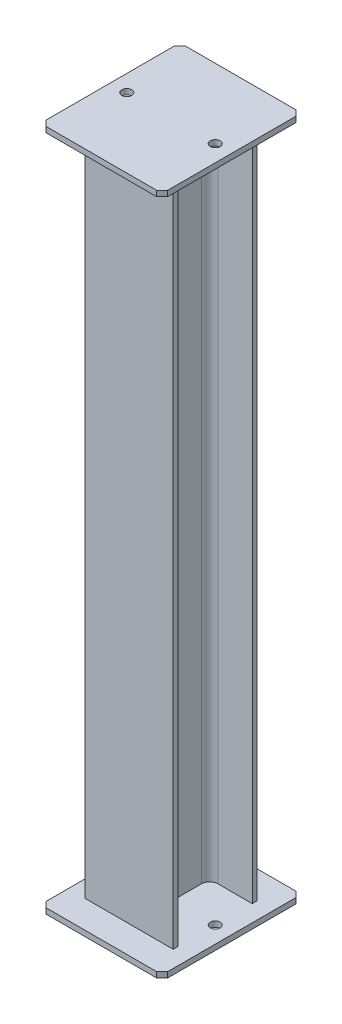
ISO-10303-21;
HEADER;
FILE_DESCRIPTION(('STEP AP214'),'2;1');
FILE_NAME('part.step','',(''),(''),'','','');
FILE_SCHEMA(('AUTOMOTIVE_DESIGN { 1 0 10303 214 1 1 1 1 }'));
ENDSEC;
DATA;
#1=APPLICATION_CONTEXT('core data for automotive mechanical design processes');
#2=APPLICATION_PROTOCOL_DEFINITION('international standard','automotive_design',2000,#1);
#3=PRODUCT_CONTEXT('',#1,'mechanical');
#4=PRODUCT('Part','Part','',(#3));
#5=PRODUCT_RELATED_PRODUCT_CATEGORY('part','',(#4));
#6=PRODUCT_DEFINITION_FORMATION('','',#4);
#7=PRODUCT_DEFINITION_CONTEXT('part definition',#1,'design');
#8=PRODUCT_DEFINITION('design','',#6,#7);
#9=PRODUCT_DEFINITION_SHAPE('','',#8);
#10=(LENGTH_UNIT() NAMED_UNIT(*) SI_UNIT(.MILLI.,.METRE.));
#11=(NAMED_UNIT(*) PLANE_ANGLE_UNIT() SI_UNIT($,.RADIAN.));
#12=(NAMED_UNIT(*) SI_UNIT($,.STERADIAN.) SOLID_ANGLE_UNIT());
#13=UNCERTAINTY_MEASURE_WITH_UNIT(LENGTH_MEASURE(1.E-05),#10,'distance_accuracy_value','');
#14=(GEOMETRIC_REPRESENTATION_CONTEXT(3) GLOBAL_UNCERTAINTY_ASSIGNED_CONTEXT((#13)) GLOBAL_UNIT_ASSIGNED_CONTEXT((#10,
#11,#12)) REPRESENTATION_CONTEXT('',''));
#15=CARTESIAN_POINT('',(0.,0.,0.));
#16=DIRECTION('',(0.,0.,1.));
#17=DIRECTION('',(1.,0.,0.));
#18=AXIS2_PLACEMENT_3D('',#15,#16,#17);
#19=CARTESIAN_POINT('',(0.,617.,0.));
#20=DIRECTION('',(0.,-1.,0.));
#21=DIRECTION('',(0.,0.,1.));
#22=AXIS2_PLACEMENT_3D('',#19,#20,#21);
#23=PLANE('',#22);
#24=DIRECTION('',(-1.,0.,0.));
#25=VECTOR('',#24,1.);
#26=CARTESIAN_POINT('',(110.,617.,126.));
#27=LINE('',#26,#25);
#28=CARTESIAN_POINT('',(100.,617.,126.));
#29=VERTEX_POINT('',#28);
#30=CARTESIAN_POINT('',(-99.9999999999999,617.,126.));
#31=VERTEX_POINT('',#30);
#32=EDGE_CURVE('E183',#29,#31,#27,.T.);
#33=ORIENTED_EDGE('',*,*,#32,.F.);
#34=DIRECTION('',(0.707106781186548,0.,-0.707106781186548));
#35=VECTOR('',#34,1.);
#36=CARTESIAN_POINT('',(100.,617.,126.));
#37=LINE('',#36,#35);
#38=CARTESIAN_POINT('',(110.,617.,116.));
#39=VERTEX_POINT('',#38);
#40=EDGE_CURVE('E220',#39,#29,#37,.F.);
#41=ORIENTED_EDGE('',*,*,#40,.F.);
#42=DIRECTION('',(0.,0.,1.));
#43=VECTOR('',#42,1.);
#44=CARTESIAN_POINT('',(110.,617.,126.));
#45=LINE('',#44,#43);
#46=CARTESIAN_POINT('',(110.,617.,-116.));
#47=VERTEX_POINT('',#46);
#48=EDGE_CURVE('E239',#47,#39,#45,.T.);
#49=ORIENTED_EDGE('',*,*,#48,.F.);
#50=DIRECTION('',(-0.707106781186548,0.,-0.707106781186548));
#51=VECTOR('',#50,1.);
#52=CARTESIAN_POINT('',(110.,617.,-116.));
#53=LINE('',#52,#51);
#54=CARTESIAN_POINT('',(100.,617.,-126.));
#55=VERTEX_POINT('',#54);
#56=EDGE_CURVE('E210',#55,#47,#53,.F.);
#57=ORIENTED_EDGE('',*,*,#56,.F.);
#58=DIRECTION('',(1.,0.,0.));
#59=VECTOR('',#58,1.);
#60=CARTESIAN_POINT('',(110.,617.,-126.));
#61=LINE('',#60,#59);
#62=CARTESIAN_POINT('',(-99.9999999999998,617.,-126.));
#63=VERTEX_POINT('',#62);
#64=EDGE_CURVE('E232',#63,#55,#61,.T.);
#65=ORIENTED_EDGE('',*,*,#64,.F.);
#66=DIRECTION('',(-0.707106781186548,0.,0.707106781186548));
#67=VECTOR('',#66,1.);
#68=CARTESIAN_POINT('',(-99.9999999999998,617.,-126.));
#69=LINE('',#68,#67);
#70=CARTESIAN_POINT('',(-110.,617.,-116.));
#71=VERTEX_POINT('',#70);
#72=EDGE_CURVE('E179',#71,#63,#69,.F.);
#73=ORIENTED_EDGE('',*,*,#72,.F.);
#74=DIRECTION('',(0.,0.,-1.));
#75=VECTOR('',#74,1.);
#76=CARTESIAN_POINT('',(-110.,617.,126.));
#77=LINE('',#76,#75);
#78=CARTESIAN_POINT('',(-110.,617.,116.));
#79=VERTEX_POINT('',#78);
#80=EDGE_CURVE('E230',#79,#71,#77,.T.);
#81=ORIENTED_EDGE('',*,*,#80,.F.);
#82=DIRECTION('',(0.707106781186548,0.,0.707106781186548));
#83=VECTOR('',#82,1.);
#84=CARTESIAN_POINT('',(-110.,617.,116.));
#85=LINE('',#84,#83);
#86=EDGE_CURVE('E14',#31,#79,#85,.F.);
#87=ORIENTED_EDGE('',*,*,#86,.F.);
#88=EDGE_LOOP('',(#33,#41,#49,#57,#65,#73,#81,#87));
#89=FACE_BOUND('',#88,.T.);
#90=CARTESIAN_POINT('',(-79.9999999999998,617.,0.));
#91=DIRECTION('',(0.,-1.,0.));
#92=DIRECTION('',(1.,0.,0.));
#93=AXIS2_PLACEMENT_3D('',#90,#91,#92);
#94=CIRCLE('',#93,9.);
#95=CARTESIAN_POINT('',(-70.9999999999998,617.,0.));
#96=VERTEX_POINT('',#95);
#97=EDGE_CURVE('E237',#96,#96,#94,.T.);
#98=ORIENTED_EDGE('',*,*,#97,.T.);
#99=EDGE_LOOP('',(#98));
#100=FACE_BOUND('',#99,.T.);
#101=CARTESIAN_POINT('',(80.0000000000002,617.,0.));
#102=DIRECTION('',(0.,-1.,0.));
#103=DIRECTION('',(1.,0.,0.));
#104=AXIS2_PLACEMENT_3D('',#101,#102,#103);
#105=CIRCLE('',#104,9.);
#106=CARTESIAN_POINT('',(89.0000000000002,617.,0.));
#107=VERTEX_POINT('',#106);
#108=EDGE_CURVE('E246',#107,#107,#105,.T.);
#109=ORIENTED_EDGE('',*,*,#108,.T.);
#110=EDGE_LOOP('',(#109));
#111=FACE_BOUND('',#110,.T.);
#112=ADVANCED_FACE('F109',(#89,#100,#111),#23,.F.);
#113=CARTESIAN_POINT('',(0.,607.,0.));
#114=DIRECTION('',(0.,-1.,0.));
#115=DIRECTION('',(0.,0.,1.));
#116=AXIS2_PLACEMENT_3D('',#113,#114,#115);
#117=PLANE('',#116);
#118=CARTESIAN_POINT('',(-79.9999999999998,607.,0.));
#119=DIRECTION('',(0.,-1.,0.));
#120=DIRECTION('',(1.,0.,0.));
#121=AXIS2_PLACEMENT_3D('',#118,#119,#120);
#122=CIRCLE('',#121,9.);
#123=CARTESIAN_POINT('',(-70.9999999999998,607.,0.));
#124=VERTEX_POINT('',#123);
#125=EDGE_CURVE('E243',#124,#124,#122,.T.);
#126=ORIENTED_EDGE('',*,*,#125,.F.);
#127=EDGE_LOOP('',(#126));
#128=FACE_BOUND('',#127,.T.);
#129=DIRECTION('',(0.,0.,-1.));
#130=VECTOR('',#129,1.);
#131=CARTESIAN_POINT('',(-110.,607.,126.));
#132=LINE('',#131,#130);
#133=CARTESIAN_POINT('',(-110.,607.,116.));
#134=VERTEX_POINT('',#133);
#135=CARTESIAN_POINT('',(-110.,607.,-116.));
#136=VERTEX_POINT('',#135);
#137=EDGE_CURVE('E193',#134,#136,#132,.T.);
#138=ORIENTED_EDGE('',*,*,#137,.T.);
#139=DIRECTION('',(0.707106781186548,0.,-0.707106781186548));
#140=VECTOR('',#139,1.);
#141=CARTESIAN_POINT('',(-113.,607.,-113.));
#142=LINE('',#141,#140);
#143=CARTESIAN_POINT('',(-99.9999999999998,607.,-126.));
#144=VERTEX_POINT('',#143);
#145=EDGE_CURVE('E176',#144,#136,#142,.F.);
#146=ORIENTED_EDGE('',*,*,#145,.F.);
#147=DIRECTION('',(1.,0.,0.));
#148=VECTOR('',#147,1.);
#149=CARTESIAN_POINT('',(110.,607.,-126.));
#150=LINE('',#149,#148);
#151=CARTESIAN_POINT('',(100.,607.,-126.));
#152=VERTEX_POINT('',#151);
#153=EDGE_CURVE('E186',#144,#152,#150,.T.);
#154=ORIENTED_EDGE('',*,*,#153,.T.);
#155=DIRECTION('',(0.707106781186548,0.,0.707106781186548));
#156=VECTOR('',#155,1.);
#157=CARTESIAN_POINT('',(113.,607.,-113.));
#158=LINE('',#157,#156);
#159=CARTESIAN_POINT('',(110.,607.,-116.));
#160=VERTEX_POINT('',#159);
#161=EDGE_CURVE('E207',#160,#152,#158,.F.);
#162=ORIENTED_EDGE('',*,*,#161,.F.);
#163=DIRECTION('',(0.,0.,1.));
#164=VECTOR('',#163,1.);
#165=CARTESIAN_POINT('',(110.,607.,126.));
#166=LINE('',#165,#164);
#167=CARTESIAN_POINT('',(110.,607.,116.));
#168=VERTEX_POINT('',#167);
#169=EDGE_CURVE('E192',#160,#168,#166,.T.);
#170=ORIENTED_EDGE('',*,*,#169,.T.);
#171=DIRECTION('',(-0.707106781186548,0.,0.707106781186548));
#172=VECTOR('',#171,1.);
#173=CARTESIAN_POINT('',(113.,607.,113.));
#174=LINE('',#173,#172);
#175=CARTESIAN_POINT('',(100.,607.,126.));
#176=VERTEX_POINT('',#175);
#177=EDGE_CURVE('E215',#176,#168,#174,.F.);
#178=ORIENTED_EDGE('',*,*,#177,.F.);
#179=DIRECTION('',(-1.,0.,0.));
#180=VECTOR('',#179,1.);
#181=CARTESIAN_POINT('',(110.,607.,126.));
#182=LINE('',#181,#180);
#183=CARTESIAN_POINT('',(-99.9999999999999,607.,126.));
#184=VERTEX_POINT('',#183);
#185=EDGE_CURVE('E228',#176,#184,#182,.T.);
#186=ORIENTED_EDGE('',*,*,#185,.T.);
#187=DIRECTION('',(-0.707106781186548,0.,-0.707106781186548));
#188=VECTOR('',#187,1.);
#189=CARTESIAN_POINT('',(-113.,607.,113.));
#190=LINE('',#189,#188);
#191=EDGE_CURVE('E225',#134,#184,#190,.F.);
#192=ORIENTED_EDGE('',*,*,#191,.F.);
#193=EDGE_LOOP('',(#138,#146,#154,#162,#170,#178,#186,#192));
#194=FACE_BOUND('',#193,.T.);
#195=CARTESIAN_POINT('',(80.0000000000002,607.,0.));
#196=DIRECTION('',(0.,-1.,0.));
#197=DIRECTION('',(1.,0.,0.));
#198=AXIS2_PLACEMENT_3D('',#195,#196,#197);
#199=CIRCLE('',#198,9.);
#200=CARTESIAN_POINT('',(89.0000000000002,607.,0.));
#201=VERTEX_POINT('',#200);
#202=EDGE_CURVE('E249',#201,#201,#199,.T.);
#203=ORIENTED_EDGE('',*,*,#202,.F.);
#204=EDGE_LOOP('',(#203));
#205=FACE_BOUND('',#204,.T.);
#206=ADVANCED_FACE('F195',(#128,#194,#205),#117,.T.);
#207=CARTESIAN_POINT('',(-110.,617.,126.));
#208=DIRECTION('',(1.,0.,0.));
#209=DIRECTION('',(0.,0.,-1.));
#210=AXIS2_PLACEMENT_3D('',#207,#208,#209);
#211=PLANE('',#210);
#212=ORIENTED_EDGE('',*,*,#80,.T.);
#213=DIRECTION('',(0.,1.,0.));
#214=VECTOR('',#213,1.);
#215=CARTESIAN_POINT('',(-110.,617.,-116.));
#216=LINE('',#215,#214);
#217=EDGE_CURVE('E199',#136,#71,#216,.T.);
#218=ORIENTED_EDGE('',*,*,#217,.F.);
#219=ORIENTED_EDGE('',*,*,#137,.F.);
#220=DIRECTION('',(0.,-1.,0.));
#221=VECTOR('',#220,1.);
#222=CARTESIAN_POINT('',(-110.,617.,116.));
#223=LINE('',#222,#221);
#224=EDGE_CURVE('E223',#79,#134,#223,.T.);
#225=ORIENTED_EDGE('',*,*,#224,.F.);
#226=EDGE_LOOP('',(#212,#218,#219,#225));
#227=FACE_BOUND('',#226,.T.);
#228=ADVANCED_FACE('F263',(#227),#211,.F.);
#229=CARTESIAN_POINT('',(110.,617.,-126.));
#230=DIRECTION('',(0.,0.,1.));
#231=DIRECTION('',(1.,0.,0.));
#232=AXIS2_PLACEMENT_3D('',#229,#230,#231);
#233=PLANE('',#232);
#234=ORIENTED_EDGE('',*,*,#153,.F.);
#235=DIRECTION('',(0.,-1.,0.));
#236=VECTOR('',#235,1.);
#237=CARTESIAN_POINT('',(-99.9999999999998,617.,-126.));
#238=LINE('',#237,#236);
#239=EDGE_CURVE('E172',#63,#144,#238,.T.);
#240=ORIENTED_EDGE('',*,*,#239,.F.);
#241=ORIENTED_EDGE('',*,*,#64,.T.);
#242=DIRECTION('',(0.,1.,0.));
#243=VECTOR('',#242,1.);
#244=CARTESIAN_POINT('',(100.,617.,-126.));
#245=LINE('',#244,#243);
#246=EDGE_CURVE('E188',#152,#55,#245,.T.);
#247=ORIENTED_EDGE('',*,*,#246,.F.);
#248=EDGE_LOOP('',(#234,#240,#241,#247));
#249=FACE_BOUND('',#248,.T.);
#250=ADVANCED_FACE('F187',(#249),#233,.F.);
#251=CARTESIAN_POINT('',(110.,617.,126.));
#252=DIRECTION('',(-1.,0.,0.));
#253=DIRECTION('',(0.,1.,0.));
#254=AXIS2_PLACEMENT_3D('',#251,#252,#253);
#255=PLANE('',#254);
#256=ORIENTED_EDGE('',*,*,#169,.F.);
#257=DIRECTION('',(0.,-1.,0.));
#258=VECTOR('',#257,1.);
#259=CARTESIAN_POINT('',(110.,617.,-116.));
#260=LINE('',#259,#258);
#261=EDGE_CURVE('E205',#47,#160,#260,.T.);
#262=ORIENTED_EDGE('',*,*,#261,.F.);
#263=ORIENTED_EDGE('',*,*,#48,.T.);
#264=DIRECTION('',(0.,1.,0.));
#265=VECTOR('',#264,1.);
#266=CARTESIAN_POINT('',(110.,617.,116.));
#267=LINE('',#266,#265);
#268=EDGE_CURVE('E218',#168,#39,#267,.T.);
#269=ORIENTED_EDGE('',*,*,#268,.F.);
#270=EDGE_LOOP('',(#256,#262,#263,#269));
#271=FACE_BOUND('',#270,.T.);
#272=ADVANCED_FACE('F280',(#271),#255,.F.);
#273=CARTESIAN_POINT('',(110.,617.,126.));
#274=DIRECTION('',(0.,0.,-1.));
#275=DIRECTION('',(-1.,0.,0.));
#276=AXIS2_PLACEMENT_3D('',#273,#274,#275);
#277=PLANE('',#276);
#278=ORIENTED_EDGE('',*,*,#185,.F.);
#279=DIRECTION('',(0.,-1.,0.));
#280=VECTOR('',#279,1.);
#281=CARTESIAN_POINT('',(100.,617.,126.));
#282=LINE('',#281,#280);
#283=EDGE_CURVE('E213',#29,#176,#282,.T.);
#284=ORIENTED_EDGE('',*,*,#283,.F.);
#285=ORIENTED_EDGE('',*,*,#32,.T.);
#286=DIRECTION('',(0.,1.,0.));
#287=VECTOR('',#286,1.);
#288=CARTESIAN_POINT('',(-99.9999999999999,617.,126.));
#289=LINE('',#288,#287);
#290=EDGE_CURVE('E117',#184,#31,#289,.T.);
#291=ORIENTED_EDGE('',*,*,#290,.F.);
#292=EDGE_LOOP('',(#278,#284,#285,#291));
#293=FACE_BOUND('',#292,.T.);
#294=ADVANCED_FACE('F277',(#293),#277,.F.);
#295=CARTESIAN_POINT('',(-79.9999999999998,617.,0.));
#296=DIRECTION('',(0.,-1.,0.));
#297=DIRECTION('',(-1.,0.,0.));
#298=AXIS2_PLACEMENT_3D('',#295,#296,#297);
#299=CYLINDRICAL_SURFACE('',#298,9.);
#300=ORIENTED_EDGE('',*,*,#97,.F.);
#301=EDGE_LOOP('',(#300));
#302=FACE_BOUND('',#301,.T.);
#303=ORIENTED_EDGE('',*,*,#125,.T.);
#304=EDGE_LOOP('',(#303));
#305=FACE_BOUND('',#304,.T.);
#306=ADVANCED_FACE('F259',(#302,#305),#299,.F.);
#307=CARTESIAN_POINT('',(80.0000000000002,617.,0.));
#308=DIRECTION('',(0.,-1.,0.));
#309=DIRECTION('',(-1.,0.,0.));
#310=AXIS2_PLACEMENT_3D('',#307,#308,#309);
#311=CYLINDRICAL_SURFACE('',#310,9.);
#312=ORIENTED_EDGE('',*,*,#108,.F.);
#313=EDGE_LOOP('',(#312));
#314=FACE_BOUND('',#313,.T.);
#315=ORIENTED_EDGE('',*,*,#202,.T.);
#316=EDGE_LOOP('',(#315));
#317=FACE_BOUND('',#316,.T.);
#318=ADVANCED_FACE('F256',(#314,#317),#311,.F.);
#319=CARTESIAN_POINT('',(-99.9999999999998,617.,-126.));
#320=DIRECTION('',(0.707106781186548,0.,0.707106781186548));
#321=DIRECTION('',(0.,-1.,0.));
#322=AXIS2_PLACEMENT_3D('',#319,#320,#321);
#323=PLANE('',#322);
#324=ORIENTED_EDGE('',*,*,#72,.T.);
#325=ORIENTED_EDGE('',*,*,#239,.T.);
#326=ORIENTED_EDGE('',*,*,#145,.T.);
#327=ORIENTED_EDGE('',*,*,#217,.T.);
#328=EDGE_LOOP('',(#324,#325,#326,#327));
#329=FACE_BOUND('',#328,.T.);
#330=ADVANCED_FACE('F174',(#329),#323,.F.);
#331=CARTESIAN_POINT('',(110.,617.,-116.));
#332=DIRECTION('',(-0.707106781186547,0.,0.707106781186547));
#333=DIRECTION('',(0.,-1.,0.));
#334=AXIS2_PLACEMENT_3D('',#331,#332,#333);
#335=PLANE('',#334);
#336=ORIENTED_EDGE('',*,*,#56,.T.);
#337=ORIENTED_EDGE('',*,*,#261,.T.);
#338=ORIENTED_EDGE('',*,*,#161,.T.);
#339=ORIENTED_EDGE('',*,*,#246,.T.);
#340=EDGE_LOOP('',(#336,#337,#338,#339));
#341=FACE_BOUND('',#340,.T.);
#342=ADVANCED_FACE('F288',(#341),#335,.F.);
#343=CARTESIAN_POINT('',(100.,617.,126.));
#344=DIRECTION('',(-0.707106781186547,0.,-0.707106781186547));
#345=DIRECTION('',(0.,-1.,0.));
#346=AXIS2_PLACEMENT_3D('',#343,#344,#345);
#347=PLANE('',#346);
#348=ORIENTED_EDGE('',*,*,#40,.T.);
#349=ORIENTED_EDGE('',*,*,#283,.T.);
#350=ORIENTED_EDGE('',*,*,#177,.T.);
#351=ORIENTED_EDGE('',*,*,#268,.T.);
#352=EDGE_LOOP('',(#348,#349,#350,#351));
#353=FACE_BOUND('',#352,.T.);
#354=ADVANCED_FACE('F290',(#353),#347,.F.);
#355=CARTESIAN_POINT('',(-110.,617.,116.));
#356=DIRECTION('',(0.707106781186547,0.,-0.707106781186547));
#357=DIRECTION('',(0.,-1.,0.));
#358=AXIS2_PLACEMENT_3D('',#355,#356,#357);
#359=PLANE('',#358);
#360=ORIENTED_EDGE('',*,*,#86,.T.);
#361=ORIENTED_EDGE('',*,*,#224,.T.);
#362=ORIENTED_EDGE('',*,*,#191,.T.);
#363=ORIENTED_EDGE('',*,*,#290,.T.);
#364=EDGE_LOOP('',(#360,#361,#362,#363));
#365=FACE_BOUND('',#364,.T.);
#366=ADVANCED_FACE('F111',(#365),#359,.F.);
#367=CLOSED_SHELL('',(#112,#206,#228,#250,#272,#294,#306,#318,#330,#342,#354,#366));
#368=MANIFOLD_SOLID_BREP('B2',#367);
#369=CARTESIAN_POINT('',(0.,-617.,0.));
#370=DIRECTION('',(0.,1.,0.));
#371=DIRECTION('',(0.,0.,1.));
#372=AXIS2_PLACEMENT_3D('',#369,#370,#371);
#373=PLANE('',#372);
#374=DIRECTION('',(-1.,0.,0.));
#375=VECTOR('',#374,1.);
#376=CARTESIAN_POINT('',(110.,-617.,126.));
#377=LINE('',#376,#375);
#378=CARTESIAN_POINT('',(100.,-617.,126.));
#379=VERTEX_POINT('',#378);
#380=CARTESIAN_POINT('',(-99.9999999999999,-617.,126.));
#381=VERTEX_POINT('',#380);
#382=EDGE_CURVE('E496',#379,#381,#377,.T.);
#383=ORIENTED_EDGE('',*,*,#382,.T.);
#384=DIRECTION('',(0.707106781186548,0.,0.707106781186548));
#385=VECTOR('',#384,1.);
#386=CARTESIAN_POINT('',(-110.,-617.,116.));
#387=LINE('',#386,#385);
#388=CARTESIAN_POINT('',(-110.,-617.,116.));
#389=VERTEX_POINT('',#388);
#390=EDGE_CURVE('E107',#381,#389,#387,.F.);
#391=ORIENTED_EDGE('',*,*,#390,.T.);
#392=DIRECTION('',(0.,0.,-1.));
#393=VECTOR('',#392,1.);
#394=CARTESIAN_POINT('',(-110.,-617.,126.));
#395=LINE('',#394,#393);
#396=CARTESIAN_POINT('',(-110.,-617.,-116.));
#397=VERTEX_POINT('',#396);
#398=EDGE_CURVE('E512',#389,#397,#395,.T.);
#399=ORIENTED_EDGE('',*,*,#398,.T.);
#400=DIRECTION('',(-0.707106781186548,0.,0.707106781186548));
#401=VECTOR('',#400,1.);
#402=CARTESIAN_POINT('',(-99.9999999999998,-617.,-126.));
#403=LINE('',#402,#401);
#404=CARTESIAN_POINT('',(-99.9999999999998,-617.,-126.));
#405=VERTEX_POINT('',#404);
#406=EDGE_CURVE('E515',#397,#405,#403,.F.);
#407=ORIENTED_EDGE('',*,*,#406,.T.);
#408=DIRECTION('',(1.,0.,0.));
#409=VECTOR('',#408,1.);
#410=CARTESIAN_POINT('',(110.,-617.,-126.));
#411=LINE('',#410,#409);
#412=CARTESIAN_POINT('',(100.,-617.,-126.));
#413=VERTEX_POINT('',#412);
#414=EDGE_CURVE('E495',#405,#413,#411,.T.);
#415=ORIENTED_EDGE('',*,*,#414,.T.);
#416=DIRECTION('',(-0.707106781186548,0.,-0.707106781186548));
#417=VECTOR('',#416,1.);
#418=CARTESIAN_POINT('',(110.,-617.,-116.));
#419=LINE('',#418,#417);
#420=CARTESIAN_POINT('',(110.,-617.,-116.));
#421=VERTEX_POINT('',#420);
#422=EDGE_CURVE('E523',#413,#421,#419,.F.);
#423=ORIENTED_EDGE('',*,*,#422,.T.);
#424=DIRECTION('',(0.,0.,1.));
#425=VECTOR('',#424,1.);
#426=CARTESIAN_POINT('',(110.,-617.,126.));
#427=LINE('',#426,#425);
#428=CARTESIAN_POINT('',(110.,-617.,116.));
#429=VERTEX_POINT('',#428);
#430=EDGE_CURVE('E548',#421,#429,#427,.T.);
#431=ORIENTED_EDGE('',*,*,#430,.T.);
#432=DIRECTION('',(0.707106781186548,0.,-0.707106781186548));
#433=VECTOR('',#432,1.);
#434=CARTESIAN_POINT('',(100.,-617.,126.));
#435=LINE('',#434,#433);
#436=EDGE_CURVE('E532',#429,#379,#435,.F.);
#437=ORIENTED_EDGE('',*,*,#436,.T.);
#438=EDGE_LOOP('',(#383,#391,#399,#407,#415,#423,#431,#437));
#439=FACE_BOUND('',#438,.T.);
#440=CARTESIAN_POINT('',(-79.9999999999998,-617.,0.));
#441=DIRECTION('',(0.,-1.,0.));
#442=DIRECTION('',(1.,0.,0.));
#443=AXIS2_PLACEMENT_3D('',#440,#441,#442);
#444=CIRCLE('',#443,9.);
#445=CARTESIAN_POINT('',(-70.9999999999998,-617.,0.));
#446=VERTEX_POINT('',#445);
#447=EDGE_CURVE('E508',#446,#446,#444,.T.);
#448=ORIENTED_EDGE('',*,*,#447,.F.);
#449=EDGE_LOOP('',(#448));
#450=FACE_BOUND('',#449,.T.);
#451=CARTESIAN_POINT('',(80.0000000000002,-617.,0.));
#452=DIRECTION('',(0.,-1.,0.));
#453=DIRECTION('',(1.,0.,0.));
#454=AXIS2_PLACEMENT_3D('',#451,#452,#453);
#455=CIRCLE('',#454,9.);
#456=CARTESIAN_POINT('',(89.0000000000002,-617.,0.));
#457=VERTEX_POINT('',#456);
#458=EDGE_CURVE('E556',#457,#457,#455,.T.);
#459=ORIENTED_EDGE('',*,*,#458,.F.);
#460=EDGE_LOOP('',(#459));
#461=FACE_BOUND('',#460,.T.);
#462=ADVANCED_FACE('F412',(#439,#450,#461),#373,.F.);
#463=CARTESIAN_POINT('',(0.,-607.,0.));
#464=DIRECTION('',(0.,1.,0.));
#465=DIRECTION('',(0.,0.,1.));
#466=AXIS2_PLACEMENT_3D('',#463,#464,#465);
#467=PLANE('',#466);
#468=CARTESIAN_POINT('',(-79.9999999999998,-607.,0.));
#469=DIRECTION('',(0.,-1.,0.));
#470=DIRECTION('',(1.,0.,0.));
#471=AXIS2_PLACEMENT_3D('',#468,#469,#470);
#472=CIRCLE('',#471,9.);
#473=CARTESIAN_POINT('',(-70.9999999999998,-607.,0.));
#474=VERTEX_POINT('',#473);
#475=EDGE_CURVE('E553',#474,#474,#472,.T.);
#476=ORIENTED_EDGE('',*,*,#475,.T.);
#477=EDGE_LOOP('',(#476));
#478=FACE_BOUND('',#477,.T.);
#479=DIRECTION('',(0.,0.,-1.));
#480=VECTOR('',#479,1.);
#481=CARTESIAN_POINT('',(-110.,-607.,126.));
#482=LINE('',#481,#480);
#483=CARTESIAN_POINT('',(-110.,-607.,116.));
#484=VERTEX_POINT('',#483);
#485=CARTESIAN_POINT('',(-110.,-607.,-116.));
#486=VERTEX_POINT('',#485);
#487=EDGE_CURVE('E503',#484,#486,#482,.T.);
#488=ORIENTED_EDGE('',*,*,#487,.F.);
#489=DIRECTION('',(-0.707106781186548,0.,-0.707106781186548));
#490=VECTOR('',#489,1.);
#491=CARTESIAN_POINT('',(-113.,-607.,113.));
#492=LINE('',#491,#490);
#493=CARTESIAN_POINT('',(-99.9999999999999,-607.,126.));
#494=VERTEX_POINT('',#493);
#495=EDGE_CURVE('E435',#484,#494,#492,.F.);
#496=ORIENTED_EDGE('',*,*,#495,.T.);
#497=DIRECTION('',(-1.,0.,0.));
#498=VECTOR('',#497,1.);
#499=CARTESIAN_POINT('',(110.,-607.,126.));
#500=LINE('',#499,#498);
#501=CARTESIAN_POINT('',(100.,-607.,126.));
#502=VERTEX_POINT('',#501);
#503=EDGE_CURVE('E506',#502,#494,#500,.T.);
#504=ORIENTED_EDGE('',*,*,#503,.F.);
#505=DIRECTION('',(-0.707106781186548,0.,0.707106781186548));
#506=VECTOR('',#505,1.);
#507=CARTESIAN_POINT('',(113.,-607.,113.));
#508=LINE('',#507,#506);
#509=CARTESIAN_POINT('',(110.,-607.,116.));
#510=VERTEX_POINT('',#509);
#511=EDGE_CURVE('E528',#502,#510,#508,.F.);
#512=ORIENTED_EDGE('',*,*,#511,.T.);
#513=DIRECTION('',(0.,0.,1.));
#514=VECTOR('',#513,1.);
#515=CARTESIAN_POINT('',(110.,-607.,126.));
#516=LINE('',#515,#514);
#517=CARTESIAN_POINT('',(110.,-607.,-116.));
#518=VERTEX_POINT('',#517);
#519=EDGE_CURVE('E502',#518,#510,#516,.T.);
#520=ORIENTED_EDGE('',*,*,#519,.F.);
#521=DIRECTION('',(0.707106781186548,0.,0.707106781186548));
#522=VECTOR('',#521,1.);
#523=CARTESIAN_POINT('',(113.,-607.,-113.));
#524=LINE('',#523,#522);
#525=CARTESIAN_POINT('',(100.,-607.,-126.));
#526=VERTEX_POINT('',#525);
#527=EDGE_CURVE('E501',#518,#526,#524,.F.);
#528=ORIENTED_EDGE('',*,*,#527,.T.);
#529=DIRECTION('',(1.,0.,0.));
#530=VECTOR('',#529,1.);
#531=CARTESIAN_POINT('',(110.,-607.,-126.));
#532=LINE('',#531,#530);
#533=CARTESIAN_POINT('',(-99.9999999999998,-607.,-126.));
#534=VERTEX_POINT('',#533);
#535=EDGE_CURVE('E492',#534,#526,#532,.T.);
#536=ORIENTED_EDGE('',*,*,#535,.F.);
#537=DIRECTION('',(0.707106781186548,0.,-0.707106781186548));
#538=VECTOR('',#537,1.);
#539=CARTESIAN_POINT('',(-113.,-607.,-113.));
#540=LINE('',#539,#538);
#541=EDGE_CURVE('E479',#534,#486,#540,.F.);
#542=ORIENTED_EDGE('',*,*,#541,.T.);
#543=EDGE_LOOP('',(#488,#496,#504,#512,#520,#528,#536,#542));
#544=FACE_BOUND('',#543,.T.);
#545=CARTESIAN_POINT('',(80.0000000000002,-607.,0.));
#546=DIRECTION('',(0.,-1.,0.));
#547=DIRECTION('',(1.,0.,0.));
#548=AXIS2_PLACEMENT_3D('',#545,#546,#547);
#549=CIRCLE('',#548,9.);
#550=CARTESIAN_POINT('',(89.0000000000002,-607.,0.));
#551=VERTEX_POINT('',#550);
#552=EDGE_CURVE('E559',#551,#551,#549,.T.);
#553=ORIENTED_EDGE('',*,*,#552,.T.);
#554=EDGE_LOOP('',(#553));
#555=FACE_BOUND('',#554,.T.);
#556=ADVANCED_FACE('F498',(#478,#544,#555),#467,.T.);
#557=CARTESIAN_POINT('',(-110.,-617.,126.));
#558=DIRECTION('',(1.,0.,0.));
#559=DIRECTION('',(0.,0.,-1.));
#560=AXIS2_PLACEMENT_3D('',#557,#558,#559);
#561=PLANE('',#560);
#562=ORIENTED_EDGE('',*,*,#398,.F.);
#563=DIRECTION('',(0.,1.,0.));
#564=VECTOR('',#563,1.);
#565=CARTESIAN_POINT('',(-110.,-617.,116.));
#566=LINE('',#565,#564);
#567=EDGE_CURVE('E534',#389,#484,#566,.T.);
#568=ORIENTED_EDGE('',*,*,#567,.T.);
#569=ORIENTED_EDGE('',*,*,#487,.T.);
#570=DIRECTION('',(0.,-1.,0.));
#571=VECTOR('',#570,1.);
#572=CARTESIAN_POINT('',(-110.,-617.,-116.));
#573=LINE('',#572,#571);
#574=EDGE_CURVE('E485',#486,#397,#573,.T.);
#575=ORIENTED_EDGE('',*,*,#574,.T.);
#576=EDGE_LOOP('',(#562,#568,#569,#575));
#577=FACE_BOUND('',#576,.T.);
#578=ADVANCED_FACE('F540',(#577),#561,.F.);
#579=CARTESIAN_POINT('',(110.,-617.,-126.));
#580=DIRECTION('',(0.,0.,1.));
#581=DIRECTION('',(1.,0.,0.));
#582=AXIS2_PLACEMENT_3D('',#579,#580,#581);
#583=PLANE('',#582);
#584=ORIENTED_EDGE('',*,*,#535,.T.);
#585=DIRECTION('',(0.,-1.,0.));
#586=VECTOR('',#585,1.);
#587=CARTESIAN_POINT('',(100.,-617.,-126.));
#588=LINE('',#587,#586);
#589=EDGE_CURVE('E521',#526,#413,#588,.T.);
#590=ORIENTED_EDGE('',*,*,#589,.T.);
#591=ORIENTED_EDGE('',*,*,#414,.F.);
#592=DIRECTION('',(0.,1.,0.));
#593=VECTOR('',#592,1.);
#594=CARTESIAN_POINT('',(-99.9999999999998,-617.,-126.));
#595=LINE('',#594,#593);
#596=EDGE_CURVE('E483',#405,#534,#595,.T.);
#597=ORIENTED_EDGE('',*,*,#596,.T.);
#598=EDGE_LOOP('',(#584,#590,#591,#597));
#599=FACE_BOUND('',#598,.T.);
#600=ADVANCED_FACE('F491',(#599),#583,.F.);
#601=CARTESIAN_POINT('',(110.,-617.,126.));
#602=DIRECTION('',(-1.,0.,0.));
#603=DIRECTION('',(0.,-1.,0.));
#604=AXIS2_PLACEMENT_3D('',#601,#602,#603);
#605=PLANE('',#604);
#606=ORIENTED_EDGE('',*,*,#519,.T.);
#607=DIRECTION('',(0.,-1.,0.));
#608=VECTOR('',#607,1.);
#609=CARTESIAN_POINT('',(110.,-617.,116.));
#610=LINE('',#609,#608);
#611=EDGE_CURVE('E530',#510,#429,#610,.T.);
#612=ORIENTED_EDGE('',*,*,#611,.T.);
#613=ORIENTED_EDGE('',*,*,#430,.F.);
#614=DIRECTION('',(0.,1.,0.));
#615=VECTOR('',#614,1.);
#616=CARTESIAN_POINT('',(110.,-617.,-116.));
#617=LINE('',#616,#615);
#618=EDGE_CURVE('E517',#421,#518,#617,.T.);
#619=ORIENTED_EDGE('',*,*,#618,.T.);
#620=EDGE_LOOP('',(#606,#612,#613,#619));
#621=FACE_BOUND('',#620,.T.);
#622=ADVANCED_FACE('F583',(#621),#605,.F.);
#623=CARTESIAN_POINT('',(110.,-617.,126.));
#624=DIRECTION('',(0.,0.,-1.));
#625=DIRECTION('',(-1.,0.,0.));
#626=AXIS2_PLACEMENT_3D('',#623,#624,#625);
#627=PLANE('',#626);
#628=ORIENTED_EDGE('',*,*,#503,.T.);
#629=DIRECTION('',(0.,-1.,0.));
#630=VECTOR('',#629,1.);
#631=CARTESIAN_POINT('',(-99.9999999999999,-617.,126.));
#632=LINE('',#631,#630);
#633=EDGE_CURVE('E421',#494,#381,#632,.T.);
#634=ORIENTED_EDGE('',*,*,#633,.T.);
#635=ORIENTED_EDGE('',*,*,#382,.F.);
#636=DIRECTION('',(0.,1.,0.));
#637=VECTOR('',#636,1.);
#638=CARTESIAN_POINT('',(100.,-617.,126.));
#639=LINE('',#638,#637);
#640=EDGE_CURVE('E525',#379,#502,#639,.T.);
#641=ORIENTED_EDGE('',*,*,#640,.T.);
#642=EDGE_LOOP('',(#628,#634,#635,#641));
#643=FACE_BOUND('',#642,.T.);
#644=ADVANCED_FACE('F580',(#643),#627,.F.);
#645=CARTESIAN_POINT('',(-79.9999999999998,-617.,0.));
#646=DIRECTION('',(0.,1.,0.));
#647=DIRECTION('',(-1.,0.,0.));
#648=AXIS2_PLACEMENT_3D('',#645,#646,#647);
#649=CYLINDRICAL_SURFACE('',#648,9.);
#650=ORIENTED_EDGE('',*,*,#447,.T.);
#651=EDGE_LOOP('',(#650));
#652=FACE_BOUND('',#651,.T.);
#653=ORIENTED_EDGE('',*,*,#475,.F.);
#654=EDGE_LOOP('',(#653));
#655=FACE_BOUND('',#654,.T.);
#656=ADVANCED_FACE('F577',(#652,#655),#649,.F.);
#657=CARTESIAN_POINT('',(80.0000000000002,-617.,0.));
#658=DIRECTION('',(0.,1.,0.));
#659=DIRECTION('',(-1.,0.,0.));
#660=AXIS2_PLACEMENT_3D('',#657,#658,#659);
#661=CYLINDRICAL_SURFACE('',#660,9.);
#662=ORIENTED_EDGE('',*,*,#458,.T.);
#663=EDGE_LOOP('',(#662));
#664=FACE_BOUND('',#663,.T.);
#665=ORIENTED_EDGE('',*,*,#552,.F.);
#666=EDGE_LOOP('',(#665));
#667=FACE_BOUND('',#666,.T.);
#668=ADVANCED_FACE('F565',(#664,#667),#661,.F.);
#669=CARTESIAN_POINT('',(-99.9999999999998,-617.,-126.));
#670=DIRECTION('',(0.707106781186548,0.,0.707106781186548));
#671=DIRECTION('',(0.,1.,0.));
#672=AXIS2_PLACEMENT_3D('',#669,#670,#671);
#673=PLANE('',#672);
#674=ORIENTED_EDGE('',*,*,#406,.F.);
#675=ORIENTED_EDGE('',*,*,#574,.F.);
#676=ORIENTED_EDGE('',*,*,#541,.F.);
#677=ORIENTED_EDGE('',*,*,#596,.F.);
#678=EDGE_LOOP('',(#674,#675,#676,#677));
#679=FACE_BOUND('',#678,.T.);
#680=ADVANCED_FACE('F482',(#679),#673,.F.);
#681=CARTESIAN_POINT('',(110.,-617.,-116.));
#682=DIRECTION('',(-0.707106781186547,0.,0.707106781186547));
#683=DIRECTION('',(0.,1.,0.));
#684=AXIS2_PLACEMENT_3D('',#681,#682,#683);
#685=PLANE('',#684);
#686=ORIENTED_EDGE('',*,*,#422,.F.);
#687=ORIENTED_EDGE('',*,*,#589,.F.);
#688=ORIENTED_EDGE('',*,*,#527,.F.);
#689=ORIENTED_EDGE('',*,*,#618,.F.);
#690=EDGE_LOOP('',(#686,#687,#688,#689));
#691=FACE_BOUND('',#690,.T.);
#692=ADVANCED_FACE('F597',(#691),#685,.F.);
#693=CARTESIAN_POINT('',(100.,-617.,126.));
#694=DIRECTION('',(-0.707106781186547,0.,-0.707106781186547));
#695=DIRECTION('',(0.,1.,0.));
#696=AXIS2_PLACEMENT_3D('',#693,#694,#695);
#697=PLANE('',#696);
#698=ORIENTED_EDGE('',*,*,#436,.F.);
#699=ORIENTED_EDGE('',*,*,#611,.F.);
#700=ORIENTED_EDGE('',*,*,#511,.F.);
#701=ORIENTED_EDGE('',*,*,#640,.F.);
#702=EDGE_LOOP('',(#698,#699,#700,#701));
#703=FACE_BOUND('',#702,.T.);
#704=ADVANCED_FACE('F602',(#703),#697,.F.);
#705=CARTESIAN_POINT('',(-110.,-617.,116.));
#706=DIRECTION('',(0.707106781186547,0.,-0.707106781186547));
#707=DIRECTION('',(0.,1.,0.));
#708=AXIS2_PLACEMENT_3D('',#705,#706,#707);
#709=PLANE('',#708);
#710=ORIENTED_EDGE('',*,*,#390,.F.);
#711=ORIENTED_EDGE('',*,*,#633,.F.);
#712=ORIENTED_EDGE('',*,*,#495,.F.);
#713=ORIENTED_EDGE('',*,*,#567,.F.);
#714=EDGE_LOOP('',(#710,#711,#712,#713));
#715=FACE_BOUND('',#714,.T.);
#716=ADVANCED_FACE('F415',(#715),#709,.F.);
#717=CLOSED_SHELL('',(#462,#556,#578,#600,#622,#644,#656,#668,#680,#692,#704,#716));
#718=MANIFOLD_SOLID_BREP('B8',#717);
#719=CARTESIAN_POINT('',(-79.9999999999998,-607.,67.));
#720=DIRECTION('',(1.,0.,0.));
#721=DIRECTION('',(0.,0.,-1.));
#722=AXIS2_PLACEMENT_3D('',#719,#720,#721);
#723=PLANE('',#722);
#724=DIRECTION('',(0.,0.,-1.));
#725=VECTOR('',#724,1.);
#726=CARTESIAN_POINT('',(-80.0000000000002,607.,67.));
#727=LINE('',#726,#725);
#728=CARTESIAN_POINT('',(-80.0000000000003,607.,76.));
#729=VERTEX_POINT('',#728);
#730=CARTESIAN_POINT('',(-80.0000000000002,607.,67.));
#731=VERTEX_POINT('',#730);
#732=EDGE_CURVE('E862',#729,#731,#727,.T.);
#733=ORIENTED_EDGE('',*,*,#732,.T.);
#734=DIRECTION('',(0.,1.,0.));
#735=VECTOR('',#734,1.);
#736=CARTESIAN_POINT('',(-79.9999999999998,-607.,67.));
#737=LINE('',#736,#735);
#738=CARTESIAN_POINT('',(-79.9999999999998,-607.,67.));
#739=VERTEX_POINT('',#738);
#740=EDGE_CURVE('E410',#739,#731,#737,.T.);
#741=ORIENTED_EDGE('',*,*,#740,.F.);
#742=DIRECTION('',(0.,0.,-1.));
#743=VECTOR('',#742,1.);
#744=CARTESIAN_POINT('',(-79.9999999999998,-607.,67.));
#745=LINE('',#744,#743);
#746=CARTESIAN_POINT('',(-79.9999999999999,-607.,76.));
#747=VERTEX_POINT('',#746);
#748=EDGE_CURVE('E892',#747,#739,#745,.T.);
#749=ORIENTED_EDGE('',*,*,#748,.F.);
#750=DIRECTION('',(0.,1.,0.));
#751=VECTOR('',#750,1.);
#752=CARTESIAN_POINT('',(-79.9999999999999,-607.,76.));
#753=LINE('',#752,#751);
#754=EDGE_CURVE('E858',#747,#729,#753,.T.);
#755=ORIENTED_EDGE('',*,*,#754,.T.);
#756=EDGE_LOOP('',(#733,#741,#749,#755));
#757=FACE_BOUND('',#756,.T.);
#758=ADVANCED_FACE('F718',(#757),#723,.F.);
#759=CARTESIAN_POINT('',(-17.9999999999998,-607.,67.));
#760=DIRECTION('',(0.,0.,1.));
#761=DIRECTION('',(1.,0.,0.));
#762=AXIS2_PLACEMENT_3D('',#759,#760,#761);
#763=PLANE('',#762);
#764=DIRECTION('',(1.,0.,0.));
#765=VECTOR('',#764,1.);
#766=CARTESIAN_POINT('',(-18.0000000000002,607.,67.));
#767=LINE('',#766,#765);
#768=CARTESIAN_POINT('',(-18.0000000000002,607.,67.));
#769=VERTEX_POINT('',#768);
#770=EDGE_CURVE('E865',#731,#769,#767,.T.);
#771=ORIENTED_EDGE('',*,*,#770,.T.);
#772=DIRECTION('',(0.,1.,0.));
#773=VECTOR('',#772,1.);
#774=CARTESIAN_POINT('',(-17.9999999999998,-607.,67.));
#775=LINE('',#774,#773);
#776=CARTESIAN_POINT('',(-17.9999999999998,-607.,67.));
#777=VERTEX_POINT('',#776);
#778=EDGE_CURVE('E726',#777,#769,#775,.T.);
#779=ORIENTED_EDGE('',*,*,#778,.F.);
#780=DIRECTION('',(1.,0.,0.));
#781=VECTOR('',#780,1.);
#782=CARTESIAN_POINT('',(-17.9999999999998,-607.,67.));
#783=LINE('',#782,#781);
#784=EDGE_CURVE('E801',#739,#777,#783,.T.);
#785=ORIENTED_EDGE('',*,*,#784,.F.);
#786=ORIENTED_EDGE('',*,*,#740,.T.);
#787=EDGE_LOOP('',(#771,#779,#785,#786));
#788=FACE_BOUND('',#787,.T.);
#789=ADVANCED_FACE('F990',(#788),#763,.F.);
#790=CARTESIAN_POINT('',(-17.9999999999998,-607.,52.));
#791=DIRECTION('',(0.,1.,0.));
#792=DIRECTION('',(-1.,0.,0.));
#793=AXIS2_PLACEMENT_3D('',#790,#791,#792);
#794=CYLINDRICAL_SURFACE('',#793,15.);
#795=CARTESIAN_POINT('',(-18.0000000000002,607.,52.));
#796=DIRECTION('',(0.,1.,0.));
#797=DIRECTION('',(1.,0.,0.));
#798=AXIS2_PLACEMENT_3D('',#795,#796,#797);
#799=CIRCLE('',#798,15.);
#800=CARTESIAN_POINT('',(-3.00000000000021,607.,52.));
#801=VERTEX_POINT('',#800);
#802=EDGE_CURVE('E867',#769,#801,#799,.T.);
#803=ORIENTED_EDGE('',*,*,#802,.T.);
#804=DIRECTION('',(0.,1.,0.));
#805=VECTOR('',#804,1.);
#806=CARTESIAN_POINT('',(-2.99999999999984,-607.,52.));
#807=LINE('',#806,#805);
#808=CARTESIAN_POINT('',(-2.99999999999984,-607.,52.));
#809=VERTEX_POINT('',#808);
#810=EDGE_CURVE('E923',#809,#801,#807,.T.);
#811=ORIENTED_EDGE('',*,*,#810,.F.);
#812=CARTESIAN_POINT('',(-17.9999999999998,-607.,52.));
#813=DIRECTION('',(0.,1.,0.));
#814=DIRECTION('',(1.,0.,0.));
#815=AXIS2_PLACEMENT_3D('',#812,#813,#814);
#816=CIRCLE('',#815,15.);
#817=EDGE_CURVE('E931',#777,#809,#816,.T.);
#818=ORIENTED_EDGE('',*,*,#817,.F.);
#819=ORIENTED_EDGE('',*,*,#778,.T.);
#820=EDGE_LOOP('',(#803,#811,#818,#819));
#821=FACE_BOUND('',#820,.T.);
#822=ADVANCED_FACE('F929',(#821),#794,.F.);
#823=CARTESIAN_POINT('',(-2.99999999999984,-607.,-52.));
#824=DIRECTION('',(1.,0.,0.));
#825=DIRECTION('',(0.,1.,0.));
#826=AXIS2_PLACEMENT_3D('',#823,#824,#825);
#827=PLANE('',#826);
#828=DIRECTION('',(0.,0.,-1.));
#829=VECTOR('',#828,1.);
#830=CARTESIAN_POINT('',(-3.00000000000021,607.,-52.));
#831=LINE('',#830,#829);
#832=CARTESIAN_POINT('',(-3.00000000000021,607.,-52.));
#833=VERTEX_POINT('',#832);
#834=EDGE_CURVE('E869',#801,#833,#831,.T.);
#835=ORIENTED_EDGE('',*,*,#834,.T.);
#836=DIRECTION('',(0.,1.,0.));
#837=VECTOR('',#836,1.);
#838=CARTESIAN_POINT('',(-2.99999999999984,-607.,-52.));
#839=LINE('',#838,#837);
#840=CARTESIAN_POINT('',(-2.99999999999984,-607.,-52.));
#841=VERTEX_POINT('',#840);
#842=EDGE_CURVE('E920',#841,#833,#839,.T.);
#843=ORIENTED_EDGE('',*,*,#842,.F.);
#844=DIRECTION('',(0.,0.,-1.));
#845=VECTOR('',#844,1.);
#846=CARTESIAN_POINT('',(-2.99999999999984,-607.,-52.));
#847=LINE('',#846,#845);
#848=EDGE_CURVE('E949',#809,#841,#847,.T.);
#849=ORIENTED_EDGE('',*,*,#848,.F.);
#850=ORIENTED_EDGE('',*,*,#810,.T.);
#851=EDGE_LOOP('',(#835,#843,#849,#850));
#852=FACE_BOUND('',#851,.T.);
#853=ADVANCED_FACE('F940',(#852),#827,.F.);
#854=CARTESIAN_POINT('',(-17.9999999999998,-607.,-52.));
#855=DIRECTION('',(0.,1.,0.));
#856=DIRECTION('',(-1.,0.,0.));
#857=AXIS2_PLACEMENT_3D('',#854,#855,#856);
#858=CYLINDRICAL_SURFACE('',#857,15.);
#859=CARTESIAN_POINT('',(-18.0000000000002,607.,-52.));
#860=DIRECTION('',(0.,1.,0.));
#861=DIRECTION('',(1.,0.,0.));
#862=AXIS2_PLACEMENT_3D('',#859,#860,#861);
#863=CIRCLE('',#862,15.);
#864=CARTESIAN_POINT('',(-18.0000000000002,607.,-67.));
#865=VERTEX_POINT('',#864);
#866=EDGE_CURVE('E871',#833,#865,#863,.T.);
#867=ORIENTED_EDGE('',*,*,#866,.T.);
#868=DIRECTION('',(0.,1.,0.));
#869=VECTOR('',#868,1.);
#870=CARTESIAN_POINT('',(-17.9999999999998,-607.,-67.));
#871=LINE('',#870,#869);
#872=CARTESIAN_POINT('',(-17.9999999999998,-607.,-67.));
#873=VERTEX_POINT('',#872);
#874=EDGE_CURVE('E917',#873,#865,#871,.T.);
#875=ORIENTED_EDGE('',*,*,#874,.F.);
#876=CARTESIAN_POINT('',(-17.9999999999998,-607.,-52.));
#877=DIRECTION('',(0.,1.,0.));
#878=DIRECTION('',(1.,0.,0.));
#879=AXIS2_PLACEMENT_3D('',#876,#877,#878);
#880=CIRCLE('',#879,15.);
#881=EDGE_CURVE('E946',#841,#873,#880,.T.);
#882=ORIENTED_EDGE('',*,*,#881,.F.);
#883=ORIENTED_EDGE('',*,*,#842,.T.);
#884=EDGE_LOOP('',(#867,#875,#882,#883));
#885=FACE_BOUND('',#884,.T.);
#886=ADVANCED_FACE('F944',(#885),#858,.F.);
#887=CARTESIAN_POINT('',(-79.9999999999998,-607.,-67.));
#888=DIRECTION('',(0.,0.,-1.));
#889=DIRECTION('',(-1.,0.,0.));
#890=AXIS2_PLACEMENT_3D('',#887,#888,#889);
#891=PLANE('',#890);
#892=DIRECTION('',(-1.,0.,0.));
#893=VECTOR('',#892,1.);
#894=CARTESIAN_POINT('',(-80.0000000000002,607.,-67.));
#895=LINE('',#894,#893);
#896=CARTESIAN_POINT('',(-80.0000000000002,607.,-67.));
#897=VERTEX_POINT('',#896);
#898=EDGE_CURVE('E873',#865,#897,#895,.T.);
#899=ORIENTED_EDGE('',*,*,#898,.T.);
#900=DIRECTION('',(0.,1.,0.));
#901=VECTOR('',#900,1.);
#902=CARTESIAN_POINT('',(-79.9999999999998,-607.,-67.));
#903=LINE('',#902,#901);
#904=CARTESIAN_POINT('',(-79.9999999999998,-607.,-67.));
#905=VERTEX_POINT('',#904);
#906=EDGE_CURVE('E914',#905,#897,#903,.T.);
#907=ORIENTED_EDGE('',*,*,#906,.F.);
#908=DIRECTION('',(-1.,0.,0.));
#909=VECTOR('',#908,1.);
#910=CARTESIAN_POINT('',(-79.9999999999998,-607.,-67.));
#911=LINE('',#910,#909);
#912=EDGE_CURVE('E948',#873,#905,#911,.T.);
#913=ORIENTED_EDGE('',*,*,#912,.F.);
#914=ORIENTED_EDGE('',*,*,#874,.T.);
#915=EDGE_LOOP('',(#899,#907,#913,#914));
#916=FACE_BOUND('',#915,.T.);
#917=ADVANCED_FACE('F1003',(#916),#891,.F.);
#918=CARTESIAN_POINT('',(-79.9999999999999,-607.,-76.));
#919=DIRECTION('',(1.,0.,0.));
#920=DIRECTION('',(0.,0.,-1.));
#921=AXIS2_PLACEMENT_3D('',#918,#919,#920);
#922=PLANE('',#921);
#923=DIRECTION('',(0.,0.,-1.));
#924=VECTOR('',#923,1.);
#925=CARTESIAN_POINT('',(-80.0000000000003,607.,-76.));
#926=LINE('',#925,#924);
#927=CARTESIAN_POINT('',(-80.0000000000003,607.,-76.));
#928=VERTEX_POINT('',#927);
#929=EDGE_CURVE('E875',#897,#928,#926,.T.);
#930=ORIENTED_EDGE('',*,*,#929,.T.);
#931=DIRECTION('',(0.,1.,0.));
#932=VECTOR('',#931,1.);
#933=CARTESIAN_POINT('',(-79.9999999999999,-607.,-76.));
#934=LINE('',#933,#932);
#935=CARTESIAN_POINT('',(-79.9999999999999,-607.,-76.));
#936=VERTEX_POINT('',#935);
#937=EDGE_CURVE('E911',#936,#928,#934,.T.);
#938=ORIENTED_EDGE('',*,*,#937,.F.);
#939=DIRECTION('',(0.,0.,-1.));
#940=VECTOR('',#939,1.);
#941=CARTESIAN_POINT('',(-79.9999999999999,-607.,-76.));
#942=LINE('',#941,#940);
#943=EDGE_CURVE('E951',#905,#936,#942,.T.);
#944=ORIENTED_EDGE('',*,*,#943,.F.);
#945=ORIENTED_EDGE('',*,*,#906,.T.);
#946=EDGE_LOOP('',(#930,#938,#944,#945));
#947=FACE_BOUND('',#946,.T.);
#948=ADVANCED_FACE('F1006',(#947),#922,.F.);
#949=CARTESIAN_POINT('',(80.0000000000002,-607.,-76.));
#950=DIRECTION('',(0.,0.,1.));
#951=DIRECTION('',(1.,0.,0.));
#952=AXIS2_PLACEMENT_3D('',#949,#950,#951);
#953=PLANE('',#952);
#954=DIRECTION('',(1.,0.,0.));
#955=VECTOR('',#954,1.);
#956=CARTESIAN_POINT('',(79.9999999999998,607.,-76.));
#957=LINE('',#956,#955);
#958=CARTESIAN_POINT('',(79.9999999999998,607.,-76.));
#959=VERTEX_POINT('',#958);
#960=EDGE_CURVE('E877',#928,#959,#957,.T.);
#961=ORIENTED_EDGE('',*,*,#960,.T.);
#962=DIRECTION('',(0.,1.,0.));
#963=VECTOR('',#962,1.);
#964=CARTESIAN_POINT('',(80.0000000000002,-607.,-76.));
#965=LINE('',#964,#963);
#966=CARTESIAN_POINT('',(80.0000000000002,-607.,-76.));
#967=VERTEX_POINT('',#966);
#968=EDGE_CURVE('E908',#967,#959,#965,.T.);
#969=ORIENTED_EDGE('',*,*,#968,.F.);
#970=DIRECTION('',(1.,0.,0.));
#971=VECTOR('',#970,1.);
#972=CARTESIAN_POINT('',(80.0000000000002,-607.,-76.));
#973=LINE('',#972,#971);
#974=EDGE_CURVE('E957',#936,#967,#973,.T.);
#975=ORIENTED_EDGE('',*,*,#974,.F.);
#976=ORIENTED_EDGE('',*,*,#937,.T.);
#977=EDGE_LOOP('',(#961,#969,#975,#976));
#978=FACE_BOUND('',#977,.T.);
#979=ADVANCED_FACE('F1010',(#978),#953,.F.);
#980=CARTESIAN_POINT('',(80.0000000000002,-607.,-67.));
#981=DIRECTION('',(-1.,0.,0.));
#982=DIRECTION('',(0.,0.,1.));
#983=AXIS2_PLACEMENT_3D('',#980,#981,#982);
#984=PLANE('',#983);
#985=DIRECTION('',(0.,0.,1.));
#986=VECTOR('',#985,1.);
#987=CARTESIAN_POINT('',(79.9999999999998,607.,-67.));
#988=LINE('',#987,#986);
#989=CARTESIAN_POINT('',(79.9999999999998,607.,-67.));
#990=VERTEX_POINT('',#989);
#991=EDGE_CURVE('E879',#959,#990,#988,.T.);
#992=ORIENTED_EDGE('',*,*,#991,.T.);
#993=DIRECTION('',(0.,1.,0.));
#994=VECTOR('',#993,1.);
#995=CARTESIAN_POINT('',(80.0000000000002,-607.,-67.));
#996=LINE('',#995,#994);
#997=CARTESIAN_POINT('',(80.0000000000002,-607.,-67.));
#998=VERTEX_POINT('',#997);
#999=EDGE_CURVE('E905',#998,#990,#996,.T.);
#1000=ORIENTED_EDGE('',*,*,#999,.F.);
#1001=DIRECTION('',(0.,0.,1.));
#1002=VECTOR('',#1001,1.);
#1003=CARTESIAN_POINT('',(80.0000000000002,-607.,-67.));
#1004=LINE('',#1003,#1002);
#1005=EDGE_CURVE('E959',#967,#998,#1004,.T.);
#1006=ORIENTED_EDGE('',*,*,#1005,.F.);
#1007=ORIENTED_EDGE('',*,*,#968,.T.);
#1008=EDGE_LOOP('',(#992,#1000,#1006,#1007));
#1009=FACE_BOUND('',#1008,.T.);
#1010=ADVANCED_FACE('F1014',(#1009),#984,.F.);
#1011=CARTESIAN_POINT('',(18.0000000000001,-607.,-67.));
#1012=DIRECTION('',(0.,0.,-1.));
#1013=DIRECTION('',(-1.,0.,0.));
#1014=AXIS2_PLACEMENT_3D('',#1011,#1012,#1013);
#1015=PLANE('',#1014);
#1016=DIRECTION('',(-1.,0.,0.));
#1017=VECTOR('',#1016,1.);
#1018=CARTESIAN_POINT('',(17.9999999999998,607.,-67.));
#1019=LINE('',#1018,#1017);
#1020=CARTESIAN_POINT('',(17.9999999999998,607.,-67.));
#1021=VERTEX_POINT('',#1020);
#1022=EDGE_CURVE('E881',#990,#1021,#1019,.T.);
#1023=ORIENTED_EDGE('',*,*,#1022,.T.);
#1024=DIRECTION('',(0.,1.,0.));
#1025=VECTOR('',#1024,1.);
#1026=CARTESIAN_POINT('',(18.0000000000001,-607.,-67.));
#1027=LINE('',#1026,#1025);
#1028=CARTESIAN_POINT('',(18.0000000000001,-607.,-67.));
#1029=VERTEX_POINT('',#1028);
#1030=EDGE_CURVE('E902',#1029,#1021,#1027,.T.);
#1031=ORIENTED_EDGE('',*,*,#1030,.F.);
#1032=DIRECTION('',(-1.,0.,0.));
#1033=VECTOR('',#1032,1.);
#1034=CARTESIAN_POINT('',(18.0000000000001,-607.,-67.));
#1035=LINE('',#1034,#1033);
#1036=EDGE_CURVE('E961',#998,#1029,#1035,.T.);
#1037=ORIENTED_EDGE('',*,*,#1036,.F.);
#1038=ORIENTED_EDGE('',*,*,#999,.T.);
#1039=EDGE_LOOP('',(#1023,#1031,#1037,#1038));
#1040=FACE_BOUND('',#1039,.T.);
#1041=ADVANCED_FACE('F1018',(#1040),#1015,.F.);
#1042=CARTESIAN_POINT('',(18.0000000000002,-607.,-52.));
#1043=DIRECTION('',(0.,1.,0.));
#1044=DIRECTION('',(-1.,0.,0.));
#1045=AXIS2_PLACEMENT_3D('',#1042,#1043,#1044);
#1046=CYLINDRICAL_SURFACE('',#1045,15.);
#1047=CARTESIAN_POINT('',(17.9999999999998,607.,-52.));
#1048=DIRECTION('',(0.,1.,0.));
#1049=DIRECTION('',(1.,0.,0.));
#1050=AXIS2_PLACEMENT_3D('',#1047,#1048,#1049);
#1051=CIRCLE('',#1050,15.);
#1052=CARTESIAN_POINT('',(2.99999999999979,607.,-52.));
#1053=VERTEX_POINT('',#1052);
#1054=EDGE_CURVE('E883',#1021,#1053,#1051,.T.);
#1055=ORIENTED_EDGE('',*,*,#1054,.T.);
#1056=DIRECTION('',(0.,1.,0.));
#1057=VECTOR('',#1056,1.);
#1058=CARTESIAN_POINT('',(3.00000000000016,-607.,-52.));
#1059=LINE('',#1058,#1057);
#1060=CARTESIAN_POINT('',(3.00000000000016,-607.,-52.));
#1061=VERTEX_POINT('',#1060);
#1062=EDGE_CURVE('E899',#1061,#1053,#1059,.T.);
#1063=ORIENTED_EDGE('',*,*,#1062,.F.);
#1064=CARTESIAN_POINT('',(18.0000000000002,-607.,-52.));
#1065=DIRECTION('',(0.,1.,0.));
#1066=DIRECTION('',(1.,0.,0.));
#1067=AXIS2_PLACEMENT_3D('',#1064,#1065,#1066);
#1068=CIRCLE('',#1067,15.);
#1069=EDGE_CURVE('E963',#1029,#1061,#1068,.T.);
#1070=ORIENTED_EDGE('',*,*,#1069,.F.);
#1071=ORIENTED_EDGE('',*,*,#1030,.T.);
#1072=EDGE_LOOP('',(#1055,#1063,#1070,#1071));
#1073=FACE_BOUND('',#1072,.T.);
#1074=ADVANCED_FACE('F1022',(#1073),#1046,.F.);
#1075=CARTESIAN_POINT('',(3.00000000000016,-607.,52.));
#1076=DIRECTION('',(-1.,0.,0.));
#1077=DIRECTION('',(0.,-1.,0.));
#1078=AXIS2_PLACEMENT_3D('',#1075,#1076,#1077);
#1079=PLANE('',#1078);
#1080=DIRECTION('',(0.,0.,1.));
#1081=VECTOR('',#1080,1.);
#1082=CARTESIAN_POINT('',(2.99999999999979,607.,52.));
#1083=LINE('',#1082,#1081);
#1084=CARTESIAN_POINT('',(2.99999999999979,607.,52.));
#1085=VERTEX_POINT('',#1084);
#1086=EDGE_CURVE('E885',#1053,#1085,#1083,.T.);
#1087=ORIENTED_EDGE('',*,*,#1086,.T.);
#1088=DIRECTION('',(0.,1.,0.));
#1089=VECTOR('',#1088,1.);
#1090=CARTESIAN_POINT('',(3.00000000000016,-607.,52.));
#1091=LINE('',#1090,#1089);
#1092=CARTESIAN_POINT('',(3.00000000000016,-607.,52.));
#1093=VERTEX_POINT('',#1092);
#1094=EDGE_CURVE('E896',#1093,#1085,#1091,.T.);
#1095=ORIENTED_EDGE('',*,*,#1094,.F.);
#1096=DIRECTION('',(0.,0.,1.));
#1097=VECTOR('',#1096,1.);
#1098=CARTESIAN_POINT('',(3.00000000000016,-607.,52.));
#1099=LINE('',#1098,#1097);
#1100=EDGE_CURVE('E965',#1061,#1093,#1099,.T.);
#1101=ORIENTED_EDGE('',*,*,#1100,.F.);
#1102=ORIENTED_EDGE('',*,*,#1062,.T.);
#1103=EDGE_LOOP('',(#1087,#1095,#1101,#1102));
#1104=FACE_BOUND('',#1103,.T.);
#1105=ADVANCED_FACE('F971',(#1104),#1079,.F.);
#1106=CARTESIAN_POINT('',(18.0000000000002,-607.,52.));
#1107=DIRECTION('',(0.,1.,0.));
#1108=DIRECTION('',(-1.,0.,0.));
#1109=AXIS2_PLACEMENT_3D('',#1106,#1107,#1108);
#1110=CYLINDRICAL_SURFACE('',#1109,15.);
#1111=CARTESIAN_POINT('',(17.9999999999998,607.,52.));
#1112=DIRECTION('',(0.,1.,0.));
#1113=DIRECTION('',(-1.,0.,0.));
#1114=AXIS2_PLACEMENT_3D('',#1111,#1112,#1113);
#1115=CIRCLE('',#1114,15.);
#1116=CARTESIAN_POINT('',(17.9999999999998,607.,67.));
#1117=VERTEX_POINT('',#1116);
#1118=EDGE_CURVE('E887',#1085,#1117,#1115,.T.);
#1119=ORIENTED_EDGE('',*,*,#1118,.T.);
#1120=DIRECTION('',(0.,1.,0.));
#1121=VECTOR('',#1120,1.);
#1122=CARTESIAN_POINT('',(18.0000000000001,-607.,67.));
#1123=LINE('',#1122,#1121);
#1124=CARTESIAN_POINT('',(18.0000000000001,-607.,67.));
#1125=VERTEX_POINT('',#1124);
#1126=EDGE_CURVE('E853',#1125,#1117,#1123,.T.);
#1127=ORIENTED_EDGE('',*,*,#1126,.F.);
#1128=CARTESIAN_POINT('',(18.0000000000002,-607.,52.));
#1129=DIRECTION('',(0.,1.,0.));
#1130=DIRECTION('',(-1.,0.,0.));
#1131=AXIS2_PLACEMENT_3D('',#1128,#1129,#1130);
#1132=CIRCLE('',#1131,15.);
#1133=EDGE_CURVE('E844',#1093,#1125,#1132,.T.);
#1134=ORIENTED_EDGE('',*,*,#1133,.F.);
#1135=ORIENTED_EDGE('',*,*,#1094,.T.);
#1136=EDGE_LOOP('',(#1119,#1127,#1134,#1135));
#1137=FACE_BOUND('',#1136,.T.);
#1138=ADVANCED_FACE('F975',(#1137),#1110,.F.);
#1139=CARTESIAN_POINT('',(80.0000000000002,-607.,67.));
#1140=DIRECTION('',(0.,0.,1.));
#1141=DIRECTION('',(1.,0.,0.));
#1142=AXIS2_PLACEMENT_3D('',#1139,#1140,#1141);
#1143=PLANE('',#1142);
#1144=DIRECTION('',(1.,0.,0.));
#1145=VECTOR('',#1144,1.);
#1146=CARTESIAN_POINT('',(79.9999999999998,607.,67.));
#1147=LINE('',#1146,#1145);
#1148=CARTESIAN_POINT('',(79.9999999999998,607.,67.));
#1149=VERTEX_POINT('',#1148);
#1150=EDGE_CURVE('E852',#1117,#1149,#1147,.T.);
#1151=ORIENTED_EDGE('',*,*,#1150,.T.);
#1152=DIRECTION('',(0.,1.,0.));
#1153=VECTOR('',#1152,1.);
#1154=CARTESIAN_POINT('',(80.0000000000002,-607.,67.));
#1155=LINE('',#1154,#1153);
#1156=CARTESIAN_POINT('',(80.0000000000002,-607.,67.));
#1157=VERTEX_POINT('',#1156);
#1158=EDGE_CURVE('E849',#1157,#1149,#1155,.T.);
#1159=ORIENTED_EDGE('',*,*,#1158,.F.);
#1160=DIRECTION('',(1.,0.,0.));
#1161=VECTOR('',#1160,1.);
#1162=CARTESIAN_POINT('',(80.0000000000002,-607.,67.));
#1163=LINE('',#1162,#1161);
#1164=EDGE_CURVE('E838',#1125,#1157,#1163,.T.);
#1165=ORIENTED_EDGE('',*,*,#1164,.F.);
#1166=ORIENTED_EDGE('',*,*,#1126,.T.);
#1167=EDGE_LOOP('',(#1151,#1159,#1165,#1166));
#1168=FACE_BOUND('',#1167,.T.);
#1169=ADVANCED_FACE('F850',(#1168),#1143,.F.);
#1170=CARTESIAN_POINT('',(80.0000000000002,-607.,76.));
#1171=DIRECTION('',(-1.,0.,0.));
#1172=DIRECTION('',(0.,0.,1.));
#1173=AXIS2_PLACEMENT_3D('',#1170,#1171,#1172);
#1174=PLANE('',#1173);
#1175=DIRECTION('',(0.,0.,1.));
#1176=VECTOR('',#1175,1.);
#1177=CARTESIAN_POINT('',(79.9999999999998,607.,76.));
#1178=LINE('',#1177,#1176);
#1179=CARTESIAN_POINT('',(79.9999999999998,607.,76.));
#1180=VERTEX_POINT('',#1179);
#1181=EDGE_CURVE('E787',#1149,#1180,#1178,.T.);
#1182=ORIENTED_EDGE('',*,*,#1181,.T.);
#1183=DIRECTION('',(0.,1.,0.));
#1184=VECTOR('',#1183,1.);
#1185=CARTESIAN_POINT('',(80.0000000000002,-607.,76.));
#1186=LINE('',#1185,#1184);
#1187=CARTESIAN_POINT('',(80.0000000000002,-607.,76.));
#1188=VERTEX_POINT('',#1187);
#1189=EDGE_CURVE('E854',#1188,#1180,#1186,.T.);
#1190=ORIENTED_EDGE('',*,*,#1189,.F.);
#1191=DIRECTION('',(0.,0.,1.));
#1192=VECTOR('',#1191,1.);
#1193=CARTESIAN_POINT('',(80.0000000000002,-607.,76.));
#1194=LINE('',#1193,#1192);
#1195=EDGE_CURVE('E842',#1157,#1188,#1194,.T.);
#1196=ORIENTED_EDGE('',*,*,#1195,.F.);
#1197=ORIENTED_EDGE('',*,*,#1158,.T.);
#1198=EDGE_LOOP('',(#1182,#1190,#1196,#1197));
#1199=FACE_BOUND('',#1198,.T.);
#1200=ADVANCED_FACE('F856',(#1199),#1174,.F.);
#1201=CARTESIAN_POINT('',(-79.9999999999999,-607.,76.));
#1202=DIRECTION('',(0.,0.,-1.));
#1203=DIRECTION('',(-1.,0.,0.));
#1204=AXIS2_PLACEMENT_3D('',#1201,#1202,#1203);
#1205=PLANE('',#1204);
#1206=DIRECTION('',(-1.,0.,0.));
#1207=VECTOR('',#1206,1.);
#1208=CARTESIAN_POINT('',(-80.0000000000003,607.,76.));
#1209=LINE('',#1208,#1207);
#1210=EDGE_CURVE('E793',#1180,#729,#1209,.T.);
#1211=ORIENTED_EDGE('',*,*,#1210,.T.);
#1212=ORIENTED_EDGE('',*,*,#754,.F.);
#1213=DIRECTION('',(-1.,0.,0.));
#1214=VECTOR('',#1213,1.);
#1215=CARTESIAN_POINT('',(-79.9999999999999,-607.,76.));
#1216=LINE('',#1215,#1214);
#1217=EDGE_CURVE('E734',#1188,#747,#1216,.T.);
#1218=ORIENTED_EDGE('',*,*,#1217,.F.);
#1219=ORIENTED_EDGE('',*,*,#1189,.T.);
#1220=EDGE_LOOP('',(#1211,#1212,#1218,#1219));
#1221=FACE_BOUND('',#1220,.T.);
#1222=ADVANCED_FACE('F979',(#1221),#1205,.F.);
#1223=CARTESIAN_POINT('',(18.0000000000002,-607.,52.));
#1224=DIRECTION('',(0.,1.,0.));
#1225=DIRECTION('',(-1.,0.,0.));
#1226=AXIS2_PLACEMENT_3D('',#1223,#1224,#1225);
#1227=PLANE('',#1226);
#1228=ORIENTED_EDGE('',*,*,#748,.T.);
#1229=ORIENTED_EDGE('',*,*,#784,.T.);
#1230=ORIENTED_EDGE('',*,*,#817,.T.);
#1231=ORIENTED_EDGE('',*,*,#848,.T.);
#1232=ORIENTED_EDGE('',*,*,#881,.T.);
#1233=ORIENTED_EDGE('',*,*,#912,.T.);
#1234=ORIENTED_EDGE('',*,*,#943,.T.);
#1235=ORIENTED_EDGE('',*,*,#974,.T.);
#1236=ORIENTED_EDGE('',*,*,#1005,.T.);
#1237=ORIENTED_EDGE('',*,*,#1036,.T.);
#1238=ORIENTED_EDGE('',*,*,#1069,.T.);
#1239=ORIENTED_EDGE('',*,*,#1100,.T.);
#1240=ORIENTED_EDGE('',*,*,#1133,.T.);
#1241=ORIENTED_EDGE('',*,*,#1164,.T.);
#1242=ORIENTED_EDGE('',*,*,#1195,.T.);
#1243=ORIENTED_EDGE('',*,*,#1217,.T.);
#1244=EDGE_LOOP('',(#1228,#1229,#1230,#1231,#1232,#1233,#1234,#1235,#1236,#1237,#1238,#1239,
#1240,#1241,#1242,#1243));
#1245=FACE_BOUND('',#1244,.T.);
#1246=ADVANCED_FACE('F840',(#1245),#1227,.F.);
#1247=CARTESIAN_POINT('',(17.9999999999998,607.,52.));
#1248=DIRECTION('',(0.,1.,0.));
#1249=DIRECTION('',(-1.,0.,0.));
#1250=AXIS2_PLACEMENT_3D('',#1247,#1248,#1249);
#1251=PLANE('',#1250);
#1252=ORIENTED_EDGE('',*,*,#732,.F.);
#1253=ORIENTED_EDGE('',*,*,#1210,.F.);
#1254=ORIENTED_EDGE('',*,*,#1181,.F.);
#1255=ORIENTED_EDGE('',*,*,#1150,.F.);
#1256=ORIENTED_EDGE('',*,*,#1118,.F.);
#1257=ORIENTED_EDGE('',*,*,#1086,.F.);
#1258=ORIENTED_EDGE('',*,*,#1054,.F.);
#1259=ORIENTED_EDGE('',*,*,#1022,.F.);
#1260=ORIENTED_EDGE('',*,*,#991,.F.);
#1261=ORIENTED_EDGE('',*,*,#960,.F.);
#1262=ORIENTED_EDGE('',*,*,#929,.F.);
#1263=ORIENTED_EDGE('',*,*,#898,.F.);
#1264=ORIENTED_EDGE('',*,*,#866,.F.);
#1265=ORIENTED_EDGE('',*,*,#834,.F.);
#1266=ORIENTED_EDGE('',*,*,#802,.F.);
#1267=ORIENTED_EDGE('',*,*,#770,.F.);
#1268=EDGE_LOOP('',(#1252,#1253,#1254,#1255,#1256,#1257,#1258,#1259,#1260,#1261,#1262,#1263,
#1264,#1265,#1266,#1267));
#1269=FACE_BOUND('',#1268,.T.);
#1270=ADVANCED_FACE('F935',(#1269),#1251,.T.);
#1271=CLOSED_SHELL('',(#758,#789,#822,#853,#886,#917,#948,#979,#1010,#1041,#1074,#1105,#1138,
#1169,#1200,#1222,#1246,#1270));
#1272=MANIFOLD_SOLID_BREP('B101',#1271);
#1273=ADVANCED_BREP_SHAPE_REPRESENTATION('',(#18,#368,#718,#1272),#14);
#1274=SHAPE_DEFINITION_REPRESENTATION(#9,#1273);
ENDSEC;
END-ISO-10303-21;
